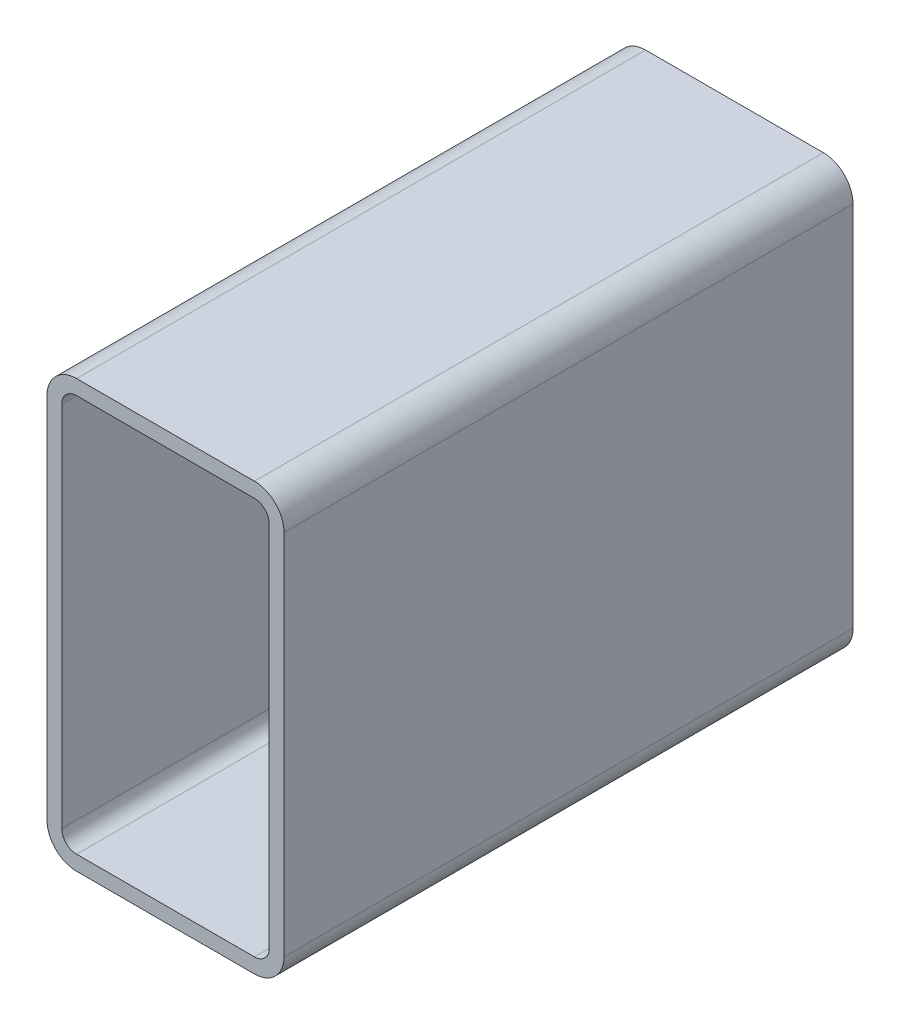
ISO-10303-21;
HEADER;
FILE_DESCRIPTION(('STEP AP214'),'2;1');
FILE_NAME('part.step','',(''),(''),'','','');
FILE_SCHEMA(('AUTOMOTIVE_DESIGN { 1 0 10303 214 1 1 1 1 }'));
ENDSEC;
DATA;
#1=APPLICATION_CONTEXT('core data for automotive mechanical design processes');
#2=APPLICATION_PROTOCOL_DEFINITION('international standard','automotive_design',2000,#1);
#3=PRODUCT_CONTEXT('',#1,'mechanical');
#4=PRODUCT('Part','Part','',(#3));
#5=PRODUCT_RELATED_PRODUCT_CATEGORY('part','',(#4));
#6=PRODUCT_DEFINITION_FORMATION('','',#4);
#7=PRODUCT_DEFINITION_CONTEXT('part definition',#1,'design');
#8=PRODUCT_DEFINITION('design','',#6,#7);
#9=PRODUCT_DEFINITION_SHAPE('','',#8);
#10=(LENGTH_UNIT() NAMED_UNIT(*) SI_UNIT(.MILLI.,.METRE.));
#11=(NAMED_UNIT(*) PLANE_ANGLE_UNIT() SI_UNIT($,.RADIAN.));
#12=(NAMED_UNIT(*) SI_UNIT($,.STERADIAN.) SOLID_ANGLE_UNIT());
#13=UNCERTAINTY_MEASURE_WITH_UNIT(LENGTH_MEASURE(1.E-05),#10,'distance_accuracy_value','');
#14=(GEOMETRIC_REPRESENTATION_CONTEXT(3) GLOBAL_UNCERTAINTY_ASSIGNED_CONTEXT((#13)) GLOBAL_UNIT_ASSIGNED_CONTEXT((#10,
#11,#12)) REPRESENTATION_CONTEXT('',''));
#15=CARTESIAN_POINT('',(0.,0.,0.));
#16=DIRECTION('',(0.,0.,1.));
#17=DIRECTION('',(1.,0.,0.));
#18=AXIS2_PLACEMENT_3D('',#15,#16,#17);
#19=CARTESIAN_POINT('',(16.7362396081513,214.668222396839,304.8));
#20=DIRECTION('',(0.,0.,1.));
#21=DIRECTION('',(1.,0.,0.));
#22=AXIS2_PLACEMENT_3D('',#19,#20,#21);
#23=PLANE('',#22);
#24=CARTESIAN_POINT('',(16.7362396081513,214.668222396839,304.8));
#25=DIRECTION('',(0.,0.,1.));
#26=DIRECTION('',(1.,0.,0.));
#27=AXIS2_PLACEMENT_3D('',#24,#25,#26);
#28=CIRCLE('',#27,15.875);
#29=CARTESIAN_POINT('',(16.7362396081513,230.543222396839,304.8));
#30=VERTEX_POINT('',#29);
#31=CARTESIAN_POINT('',(0.8612396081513,214.668222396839,304.8));
#32=VERTEX_POINT('',#31);
#33=EDGE_CURVE('E211',#30,#32,#28,.T.);
#34=ORIENTED_EDGE('',*,*,#33,.T.);
#35=DIRECTION('',(0.,-1.,0.));
#36=VECTOR('',#35,1.);
#37=CARTESIAN_POINT('',(0.8612396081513,17.8182223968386,304.8));
#38=LINE('',#37,#36);
#39=CARTESIAN_POINT('',(0.8612396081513,17.8182223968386,304.8));
#40=VERTEX_POINT('',#39);
#41=EDGE_CURVE('E214',#32,#40,#38,.T.);
#42=ORIENTED_EDGE('',*,*,#41,.T.);
#43=CARTESIAN_POINT('',(16.7362396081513,17.8182223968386,304.8));
#44=DIRECTION('',(0.,0.,1.));
#45=DIRECTION('',(1.,0.,0.));
#46=AXIS2_PLACEMENT_3D('',#43,#44,#45);
#47=CIRCLE('',#46,15.875);
#48=CARTESIAN_POINT('',(16.7362396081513,1.94322239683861,304.8));
#49=VERTEX_POINT('',#48);
#50=EDGE_CURVE('E217',#40,#49,#47,.T.);
#51=ORIENTED_EDGE('',*,*,#50,.T.);
#52=DIRECTION('',(1.,0.,0.));
#53=VECTOR('',#52,1.);
#54=CARTESIAN_POINT('',(111.986239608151,1.94322239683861,304.8));
#55=LINE('',#54,#53);
#56=CARTESIAN_POINT('',(111.986239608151,1.94322239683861,304.8));
#57=VERTEX_POINT('',#56);
#58=EDGE_CURVE('E219',#49,#57,#55,.T.);
#59=ORIENTED_EDGE('',*,*,#58,.T.);
#60=CARTESIAN_POINT('',(111.986239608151,17.8182223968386,304.8));
#61=DIRECTION('',(0.,0.,1.));
#62=DIRECTION('',(1.,0.,0.));
#63=AXIS2_PLACEMENT_3D('',#60,#61,#62);
#64=CIRCLE('',#63,15.875);
#65=CARTESIAN_POINT('',(127.861239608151,17.8182223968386,304.8));
#66=VERTEX_POINT('',#65);
#67=EDGE_CURVE('E221',#57,#66,#64,.T.);
#68=ORIENTED_EDGE('',*,*,#67,.T.);
#69=DIRECTION('',(0.,1.,0.));
#70=VECTOR('',#69,1.);
#71=CARTESIAN_POINT('',(127.861239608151,214.668222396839,304.8));
#72=LINE('',#71,#70);
#73=CARTESIAN_POINT('',(127.861239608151,214.668222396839,304.8));
#74=VERTEX_POINT('',#73);
#75=EDGE_CURVE('E223',#66,#74,#72,.T.);
#76=ORIENTED_EDGE('',*,*,#75,.T.);
#77=CARTESIAN_POINT('',(111.986239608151,214.668222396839,304.8));
#78=DIRECTION('',(0.,0.,1.));
#79=DIRECTION('',(1.,0.,0.));
#80=AXIS2_PLACEMENT_3D('',#77,#78,#79);
#81=CIRCLE('',#80,15.875);
#82=CARTESIAN_POINT('',(111.986239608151,230.543222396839,304.8));
#83=VERTEX_POINT('',#82);
#84=EDGE_CURVE('E225',#74,#83,#81,.T.);
#85=ORIENTED_EDGE('',*,*,#84,.T.);
#86=DIRECTION('',(-1.,0.,0.));
#87=VECTOR('',#86,1.);
#88=CARTESIAN_POINT('',(16.7362396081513,230.543222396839,304.8));
#89=LINE('',#88,#87);
#90=EDGE_CURVE('E227',#83,#30,#89,.T.);
#91=ORIENTED_EDGE('',*,*,#90,.T.);
#92=EDGE_LOOP('',(#34,#42,#51,#59,#68,#76,#85,#91));
#93=FACE_BOUND('',#92,.T.);
#94=DIRECTION('',(0.,-1.,0.));
#95=VECTOR('',#94,1.);
#96=CARTESIAN_POINT('',(8.7987396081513,17.8182223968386,304.8));
#97=LINE('',#96,#95);
#98=CARTESIAN_POINT('',(8.7987396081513,214.668222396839,304.8));
#99=VERTEX_POINT('',#98);
#100=CARTESIAN_POINT('',(8.7987396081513,17.8182223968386,304.8));
#101=VERTEX_POINT('',#100);
#102=EDGE_CURVE('E154',#99,#101,#97,.T.);
#103=ORIENTED_EDGE('',*,*,#102,.F.);
#104=CARTESIAN_POINT('',(16.7362396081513,214.668222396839,304.8));
#105=DIRECTION('',(0.,0.,1.));
#106=DIRECTION('',(1.,0.,0.));
#107=AXIS2_PLACEMENT_3D('',#104,#105,#106);
#108=CIRCLE('',#107,7.9375);
#109=CARTESIAN_POINT('',(16.7362396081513,222.605722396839,304.8));
#110=VERTEX_POINT('',#109);
#111=EDGE_CURVE('E146',#110,#99,#108,.T.);
#112=ORIENTED_EDGE('',*,*,#111,.F.);
#113=DIRECTION('',(-1.,0.,0.));
#114=VECTOR('',#113,1.);
#115=CARTESIAN_POINT('',(16.7362396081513,222.605722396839,304.8));
#116=LINE('',#115,#114);
#117=CARTESIAN_POINT('',(111.986239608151,222.605722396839,304.8));
#118=VERTEX_POINT('',#117);
#119=EDGE_CURVE('E179',#118,#110,#116,.T.);
#120=ORIENTED_EDGE('',*,*,#119,.F.);
#121=CARTESIAN_POINT('',(111.986239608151,214.668222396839,304.8));
#122=DIRECTION('',(0.,0.,1.));
#123=DIRECTION('',(1.,0.,0.));
#124=AXIS2_PLACEMENT_3D('',#121,#122,#123);
#125=CIRCLE('',#124,7.9375);
#126=CARTESIAN_POINT('',(119.923739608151,214.668222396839,304.8));
#127=VERTEX_POINT('',#126);
#128=EDGE_CURVE('E177',#127,#118,#125,.T.);
#129=ORIENTED_EDGE('',*,*,#128,.F.);
#130=DIRECTION('',(0.,1.,0.));
#131=VECTOR('',#130,1.);
#132=CARTESIAN_POINT('',(119.923739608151,214.668222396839,304.8));
#133=LINE('',#132,#131);
#134=CARTESIAN_POINT('',(119.923739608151,17.8182223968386,304.8));
#135=VERTEX_POINT('',#134);
#136=EDGE_CURVE('E175',#135,#127,#133,.T.);
#137=ORIENTED_EDGE('',*,*,#136,.F.);
#138=CARTESIAN_POINT('',(111.986239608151,17.8182223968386,304.8));
#139=DIRECTION('',(0.,0.,1.));
#140=DIRECTION('',(1.,0.,0.));
#141=AXIS2_PLACEMENT_3D('',#138,#139,#140);
#142=CIRCLE('',#141,7.9375);
#143=CARTESIAN_POINT('',(111.986239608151,9.88072239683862,304.8));
#144=VERTEX_POINT('',#143);
#145=EDGE_CURVE('E173',#144,#135,#142,.T.);
#146=ORIENTED_EDGE('',*,*,#145,.F.);
#147=DIRECTION('',(1.,0.,0.));
#148=VECTOR('',#147,1.);
#149=CARTESIAN_POINT('',(111.986239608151,9.88072239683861,304.8));
#150=LINE('',#149,#148);
#151=CARTESIAN_POINT('',(16.7362396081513,9.88072239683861,304.8));
#152=VERTEX_POINT('',#151);
#153=EDGE_CURVE('E169',#152,#144,#150,.T.);
#154=ORIENTED_EDGE('',*,*,#153,.F.);
#155=CARTESIAN_POINT('',(16.7362396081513,17.8182223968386,304.8));
#156=DIRECTION('',(0.,0.,1.));
#157=DIRECTION('',(1.,0.,0.));
#158=AXIS2_PLACEMENT_3D('',#155,#156,#157);
#159=CIRCLE('',#158,7.9375);
#160=EDGE_CURVE('E167',#101,#152,#159,.T.);
#161=ORIENTED_EDGE('',*,*,#160,.F.);
#162=EDGE_LOOP('',(#103,#112,#120,#129,#137,#146,#154,#161));
#163=FACE_BOUND('',#162,.T.);
#164=ADVANCED_FACE('F33',(#93,#163),#23,.T.);
#165=CARTESIAN_POINT('',(16.7362396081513,214.668222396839,0.));
#166=DIRECTION('',(0.,0.,1.));
#167=DIRECTION('',(1.,0.,0.));
#168=AXIS2_PLACEMENT_3D('',#165,#166,#167);
#169=PLANE('',#168);
#170=CARTESIAN_POINT('',(16.7362396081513,214.668222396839,0.));
#171=DIRECTION('',(0.,0.,1.));
#172=DIRECTION('',(1.,0.,0.));
#173=AXIS2_PLACEMENT_3D('',#170,#171,#172);
#174=CIRCLE('',#173,15.875);
#175=CARTESIAN_POINT('',(16.7362396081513,230.543222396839,0.));
#176=VERTEX_POINT('',#175);
#177=CARTESIAN_POINT('',(0.8612396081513,214.668222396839,0.));
#178=VERTEX_POINT('',#177);
#179=EDGE_CURVE('E162',#176,#178,#174,.T.);
#180=ORIENTED_EDGE('',*,*,#179,.F.);
#181=DIRECTION('',(-1.,0.,0.));
#182=VECTOR('',#181,1.);
#183=CARTESIAN_POINT('',(16.7362396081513,230.543222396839,0.));
#184=LINE('',#183,#182);
#185=CARTESIAN_POINT('',(111.986239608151,230.543222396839,0.));
#186=VERTEX_POINT('',#185);
#187=EDGE_CURVE('E215',#186,#176,#184,.T.);
#188=ORIENTED_EDGE('',*,*,#187,.F.);
#189=CARTESIAN_POINT('',(111.986239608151,214.668222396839,0.));
#190=DIRECTION('',(0.,0.,1.));
#191=DIRECTION('',(1.,0.,0.));
#192=AXIS2_PLACEMENT_3D('',#189,#190,#191);
#193=CIRCLE('',#192,15.875);
#194=CARTESIAN_POINT('',(127.861239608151,214.668222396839,0.));
#195=VERTEX_POINT('',#194);
#196=EDGE_CURVE('E242',#195,#186,#193,.T.);
#197=ORIENTED_EDGE('',*,*,#196,.F.);
#198=DIRECTION('',(0.,1.,0.));
#199=VECTOR('',#198,1.);
#200=CARTESIAN_POINT('',(127.861239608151,214.668222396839,0.));
#201=LINE('',#200,#199);
#202=CARTESIAN_POINT('',(127.861239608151,17.8182223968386,0.));
#203=VERTEX_POINT('',#202);
#204=EDGE_CURVE('E240',#203,#195,#201,.T.);
#205=ORIENTED_EDGE('',*,*,#204,.F.);
#206=CARTESIAN_POINT('',(111.986239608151,17.8182223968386,0.));
#207=DIRECTION('',(0.,0.,1.));
#208=DIRECTION('',(1.,0.,0.));
#209=AXIS2_PLACEMENT_3D('',#206,#207,#208);
#210=CIRCLE('',#209,15.875);
#211=CARTESIAN_POINT('',(111.986239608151,1.94322239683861,0.));
#212=VERTEX_POINT('',#211);
#213=EDGE_CURVE('E238',#212,#203,#210,.T.);
#214=ORIENTED_EDGE('',*,*,#213,.F.);
#215=DIRECTION('',(1.,0.,0.));
#216=VECTOR('',#215,1.);
#217=CARTESIAN_POINT('',(111.986239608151,1.94322239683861,0.));
#218=LINE('',#217,#216);
#219=CARTESIAN_POINT('',(16.7362396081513,1.94322239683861,0.));
#220=VERTEX_POINT('',#219);
#221=EDGE_CURVE('E236',#220,#212,#218,.T.);
#222=ORIENTED_EDGE('',*,*,#221,.F.);
#223=CARTESIAN_POINT('',(16.7362396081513,17.8182223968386,0.));
#224=DIRECTION('',(0.,0.,1.));
#225=DIRECTION('',(1.,0.,0.));
#226=AXIS2_PLACEMENT_3D('',#223,#224,#225);
#227=CIRCLE('',#226,15.875);
#228=CARTESIAN_POINT('',(0.8612396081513,17.8182223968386,0.));
#229=VERTEX_POINT('',#228);
#230=EDGE_CURVE('E234',#229,#220,#227,.T.);
#231=ORIENTED_EDGE('',*,*,#230,.F.);
#232=DIRECTION('',(0.,-1.,0.));
#233=VECTOR('',#232,1.);
#234=CARTESIAN_POINT('',(0.8612396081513,17.8182223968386,0.));
#235=LINE('',#234,#233);
#236=EDGE_CURVE('E232',#178,#229,#235,.T.);
#237=ORIENTED_EDGE('',*,*,#236,.F.);
#238=EDGE_LOOP('',(#180,#188,#197,#205,#214,#222,#231,#237));
#239=FACE_BOUND('',#238,.T.);
#240=CARTESIAN_POINT('',(16.7362396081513,214.668222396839,0.));
#241=DIRECTION('',(0.,0.,1.));
#242=DIRECTION('',(1.,0.,0.));
#243=AXIS2_PLACEMENT_3D('',#240,#241,#242);
#244=CIRCLE('',#243,7.9375);
#245=CARTESIAN_POINT('',(16.7362396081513,222.605722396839,0.));
#246=VERTEX_POINT('',#245);
#247=CARTESIAN_POINT('',(8.7987396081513,214.668222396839,0.));
#248=VERTEX_POINT('',#247);
#249=EDGE_CURVE('E56',#246,#248,#244,.T.);
#250=ORIENTED_EDGE('',*,*,#249,.T.);
#251=DIRECTION('',(0.,-1.,0.));
#252=VECTOR('',#251,1.);
#253=CARTESIAN_POINT('',(8.7987396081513,17.8182223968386,0.));
#254=LINE('',#253,#252);
#255=CARTESIAN_POINT('',(8.7987396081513,17.8182223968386,0.));
#256=VERTEX_POINT('',#255);
#257=EDGE_CURVE('E161',#248,#256,#254,.T.);
#258=ORIENTED_EDGE('',*,*,#257,.T.);
#259=CARTESIAN_POINT('',(16.7362396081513,17.8182223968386,0.));
#260=DIRECTION('',(0.,0.,1.));
#261=DIRECTION('',(1.,0.,0.));
#262=AXIS2_PLACEMENT_3D('',#259,#260,#261);
#263=CIRCLE('',#262,7.9375);
#264=CARTESIAN_POINT('',(16.7362396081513,9.88072239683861,0.));
#265=VERTEX_POINT('',#264);
#266=EDGE_CURVE('E183',#256,#265,#263,.T.);
#267=ORIENTED_EDGE('',*,*,#266,.T.);
#268=DIRECTION('',(1.,0.,0.));
#269=VECTOR('',#268,1.);
#270=CARTESIAN_POINT('',(111.986239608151,9.88072239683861,0.));
#271=LINE('',#270,#269);
#272=CARTESIAN_POINT('',(111.986239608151,9.88072239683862,0.));
#273=VERTEX_POINT('',#272);
#274=EDGE_CURVE('E186',#265,#273,#271,.T.);
#275=ORIENTED_EDGE('',*,*,#274,.T.);
#276=CARTESIAN_POINT('',(111.986239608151,17.8182223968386,0.));
#277=DIRECTION('',(0.,0.,1.));
#278=DIRECTION('',(1.,0.,0.));
#279=AXIS2_PLACEMENT_3D('',#276,#277,#278);
#280=CIRCLE('',#279,7.9375);
#281=CARTESIAN_POINT('',(119.923739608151,17.8182223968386,0.));
#282=VERTEX_POINT('',#281);
#283=EDGE_CURVE('E189',#273,#282,#280,.T.);
#284=ORIENTED_EDGE('',*,*,#283,.T.);
#285=DIRECTION('',(0.,1.,0.));
#286=VECTOR('',#285,1.);
#287=CARTESIAN_POINT('',(119.923739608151,214.668222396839,0.));
#288=LINE('',#287,#286);
#289=CARTESIAN_POINT('',(119.923739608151,214.668222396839,0.));
#290=VERTEX_POINT('',#289);
#291=EDGE_CURVE('E192',#282,#290,#288,.T.);
#292=ORIENTED_EDGE('',*,*,#291,.T.);
#293=CARTESIAN_POINT('',(111.986239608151,214.668222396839,0.));
#294=DIRECTION('',(0.,0.,1.));
#295=DIRECTION('',(1.,0.,0.));
#296=AXIS2_PLACEMENT_3D('',#293,#294,#295);
#297=CIRCLE('',#296,7.9375);
#298=CARTESIAN_POINT('',(111.986239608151,222.605722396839,0.));
#299=VERTEX_POINT('',#298);
#300=EDGE_CURVE('E195',#290,#299,#297,.T.);
#301=ORIENTED_EDGE('',*,*,#300,.T.);
#302=DIRECTION('',(-1.,0.,0.));
#303=VECTOR('',#302,1.);
#304=CARTESIAN_POINT('',(16.7362396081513,222.605722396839,0.));
#305=LINE('',#304,#303);
#306=EDGE_CURVE('E155',#299,#246,#305,.T.);
#307=ORIENTED_EDGE('',*,*,#306,.T.);
#308=EDGE_LOOP('',(#250,#258,#267,#275,#284,#292,#301,#307));
#309=FACE_BOUND('',#308,.T.);
#310=ADVANCED_FACE('F272',(#239,#309),#169,.F.);
#311=CARTESIAN_POINT('',(16.7362396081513,214.668222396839,304.8));
#312=DIRECTION('',(0.,0.,-1.));
#313=DIRECTION('',(-1.,0.,0.));
#314=AXIS2_PLACEMENT_3D('',#311,#312,#313);
#315=CYLINDRICAL_SURFACE('',#314,15.875);
#316=ORIENTED_EDGE('',*,*,#179,.T.);
#317=DIRECTION('',(0.,0.,-1.));
#318=VECTOR('',#317,1.);
#319=CARTESIAN_POINT('',(0.8612396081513,214.668222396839,304.8));
#320=LINE('',#319,#318);
#321=EDGE_CURVE('E11',#32,#178,#320,.T.);
#322=ORIENTED_EDGE('',*,*,#321,.F.);
#323=ORIENTED_EDGE('',*,*,#33,.F.);
#324=DIRECTION('',(0.,0.,-1.));
#325=VECTOR('',#324,1.);
#326=CARTESIAN_POINT('',(16.7362396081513,230.543222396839,304.8));
#327=LINE('',#326,#325);
#328=EDGE_CURVE('E229',#30,#176,#327,.T.);
#329=ORIENTED_EDGE('',*,*,#328,.T.);
#330=EDGE_LOOP('',(#316,#322,#323,#329));
#331=FACE_BOUND('',#330,.T.);
#332=ADVANCED_FACE('F35',(#331),#315,.T.);
#333=CARTESIAN_POINT('',(0.8612396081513,17.8182223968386,304.8));
#334=DIRECTION('',(1.,0.,0.));
#335=DIRECTION('',(0.,0.,-1.));
#336=AXIS2_PLACEMENT_3D('',#333,#334,#335);
#337=PLANE('',#336);
#338=ORIENTED_EDGE('',*,*,#236,.T.);
#339=DIRECTION('',(0.,0.,-1.));
#340=VECTOR('',#339,1.);
#341=CARTESIAN_POINT('',(0.8612396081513,17.8182223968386,304.8));
#342=LINE('',#341,#340);
#343=EDGE_CURVE('E41',#40,#229,#342,.T.);
#344=ORIENTED_EDGE('',*,*,#343,.F.);
#345=ORIENTED_EDGE('',*,*,#41,.F.);
#346=ORIENTED_EDGE('',*,*,#321,.T.);
#347=EDGE_LOOP('',(#338,#344,#345,#346));
#348=FACE_BOUND('',#347,.T.);
#349=ADVANCED_FACE('F289',(#348),#337,.F.);
#350=CARTESIAN_POINT('',(16.7362396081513,17.8182223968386,304.8));
#351=DIRECTION('',(0.,0.,-1.));
#352=DIRECTION('',(-1.,0.,0.));
#353=AXIS2_PLACEMENT_3D('',#350,#351,#352);
#354=CYLINDRICAL_SURFACE('',#353,15.875);
#355=ORIENTED_EDGE('',*,*,#230,.T.);
#356=DIRECTION('',(0.,0.,-1.));
#357=VECTOR('',#356,1.);
#358=CARTESIAN_POINT('',(16.7362396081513,1.94322239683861,304.8));
#359=LINE('',#358,#357);
#360=EDGE_CURVE('E259',#49,#220,#359,.T.);
#361=ORIENTED_EDGE('',*,*,#360,.F.);
#362=ORIENTED_EDGE('',*,*,#50,.F.);
#363=ORIENTED_EDGE('',*,*,#343,.T.);
#364=EDGE_LOOP('',(#355,#361,#362,#363));
#365=FACE_BOUND('',#364,.T.);
#366=ADVANCED_FACE('F266',(#365),#354,.T.);
#367=CARTESIAN_POINT('',(111.986239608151,1.94322239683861,304.8));
#368=DIRECTION('',(0.,1.,0.));
#369=DIRECTION('',(0.,0.,1.));
#370=AXIS2_PLACEMENT_3D('',#367,#368,#369);
#371=PLANE('',#370);
#372=ORIENTED_EDGE('',*,*,#221,.T.);
#373=DIRECTION('',(0.,0.,-1.));
#374=VECTOR('',#373,1.);
#375=CARTESIAN_POINT('',(111.986239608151,1.94322239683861,304.8));
#376=LINE('',#375,#374);
#377=EDGE_CURVE('E256',#57,#212,#376,.T.);
#378=ORIENTED_EDGE('',*,*,#377,.F.);
#379=ORIENTED_EDGE('',*,*,#58,.F.);
#380=ORIENTED_EDGE('',*,*,#360,.T.);
#381=EDGE_LOOP('',(#372,#378,#379,#380));
#382=FACE_BOUND('',#381,.T.);
#383=ADVANCED_FACE('F278',(#382),#371,.F.);
#384=CARTESIAN_POINT('',(111.986239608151,17.8182223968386,304.8));
#385=DIRECTION('',(0.,0.,-1.));
#386=DIRECTION('',(-1.,0.,0.));
#387=AXIS2_PLACEMENT_3D('',#384,#385,#386);
#388=CYLINDRICAL_SURFACE('',#387,15.875);
#389=ORIENTED_EDGE('',*,*,#213,.T.);
#390=DIRECTION('',(0.,0.,-1.));
#391=VECTOR('',#390,1.);
#392=CARTESIAN_POINT('',(127.861239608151,17.8182223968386,304.8));
#393=LINE('',#392,#391);
#394=EDGE_CURVE('E253',#66,#203,#393,.T.);
#395=ORIENTED_EDGE('',*,*,#394,.F.);
#396=ORIENTED_EDGE('',*,*,#67,.F.);
#397=ORIENTED_EDGE('',*,*,#377,.T.);
#398=EDGE_LOOP('',(#389,#395,#396,#397));
#399=FACE_BOUND('',#398,.T.);
#400=ADVANCED_FACE('F282',(#399),#388,.T.);
#401=CARTESIAN_POINT('',(127.861239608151,214.668222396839,304.8));
#402=DIRECTION('',(-1.,0.,0.));
#403=DIRECTION('',(0.,0.,1.));
#404=AXIS2_PLACEMENT_3D('',#401,#402,#403);
#405=PLANE('',#404);
#406=ORIENTED_EDGE('',*,*,#204,.T.);
#407=DIRECTION('',(0.,0.,-1.));
#408=VECTOR('',#407,1.);
#409=CARTESIAN_POINT('',(127.861239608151,214.668222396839,304.8));
#410=LINE('',#409,#408);
#411=EDGE_CURVE('E250',#74,#195,#410,.T.);
#412=ORIENTED_EDGE('',*,*,#411,.F.);
#413=ORIENTED_EDGE('',*,*,#75,.F.);
#414=ORIENTED_EDGE('',*,*,#394,.T.);
#415=EDGE_LOOP('',(#406,#412,#413,#414));
#416=FACE_BOUND('',#415,.T.);
#417=ADVANCED_FACE('F302',(#416),#405,.F.);
#418=CARTESIAN_POINT('',(111.986239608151,214.668222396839,304.8));
#419=DIRECTION('',(0.,0.,-1.));
#420=DIRECTION('',(-1.,0.,0.));
#421=AXIS2_PLACEMENT_3D('',#418,#419,#420);
#422=CYLINDRICAL_SURFACE('',#421,15.875);
#423=ORIENTED_EDGE('',*,*,#196,.T.);
#424=DIRECTION('',(0.,0.,-1.));
#425=VECTOR('',#424,1.);
#426=CARTESIAN_POINT('',(111.986239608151,230.543222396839,304.8));
#427=LINE('',#426,#425);
#428=EDGE_CURVE('E247',#83,#186,#427,.T.);
#429=ORIENTED_EDGE('',*,*,#428,.F.);
#430=ORIENTED_EDGE('',*,*,#84,.F.);
#431=ORIENTED_EDGE('',*,*,#411,.T.);
#432=EDGE_LOOP('',(#423,#429,#430,#431));
#433=FACE_BOUND('',#432,.T.);
#434=ADVANCED_FACE('F300',(#433),#422,.T.);
#435=CARTESIAN_POINT('',(16.7362396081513,230.543222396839,304.8));
#436=DIRECTION('',(0.,-1.,0.));
#437=DIRECTION('',(0.,0.,-1.));
#438=AXIS2_PLACEMENT_3D('',#435,#436,#437);
#439=PLANE('',#438);
#440=ORIENTED_EDGE('',*,*,#187,.T.);
#441=ORIENTED_EDGE('',*,*,#328,.F.);
#442=ORIENTED_EDGE('',*,*,#90,.F.);
#443=ORIENTED_EDGE('',*,*,#428,.T.);
#444=EDGE_LOOP('',(#440,#441,#442,#443));
#445=FACE_BOUND('',#444,.T.);
#446=ADVANCED_FACE('F295',(#445),#439,.F.);
#447=CARTESIAN_POINT('',(16.7362396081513,214.668222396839,304.8));
#448=DIRECTION('',(0.,0.,-1.));
#449=DIRECTION('',(-1.,0.,0.));
#450=AXIS2_PLACEMENT_3D('',#447,#448,#449);
#451=CYLINDRICAL_SURFACE('',#450,7.9375);
#452=ORIENTED_EDGE('',*,*,#249,.F.);
#453=DIRECTION('',(0.,0.,-1.));
#454=VECTOR('',#453,1.);
#455=CARTESIAN_POINT('',(16.7362396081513,222.605722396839,304.8));
#456=LINE('',#455,#454);
#457=EDGE_CURVE('E150',#110,#246,#456,.T.);
#458=ORIENTED_EDGE('',*,*,#457,.F.);
#459=ORIENTED_EDGE('',*,*,#111,.T.);
#460=DIRECTION('',(0.,0.,-1.));
#461=VECTOR('',#460,1.);
#462=CARTESIAN_POINT('',(8.7987396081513,214.668222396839,304.8));
#463=LINE('',#462,#461);
#464=EDGE_CURVE('E149',#99,#248,#463,.T.);
#465=ORIENTED_EDGE('',*,*,#464,.T.);
#466=EDGE_LOOP('',(#452,#458,#459,#465));
#467=FACE_BOUND('',#466,.T.);
#468=ADVANCED_FACE('F148',(#467),#451,.F.);
#469=CARTESIAN_POINT('',(8.7987396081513,17.8182223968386,304.8));
#470=DIRECTION('',(1.,0.,0.));
#471=DIRECTION('',(0.,0.,-1.));
#472=AXIS2_PLACEMENT_3D('',#469,#470,#471);
#473=PLANE('',#472);
#474=ORIENTED_EDGE('',*,*,#257,.F.);
#475=ORIENTED_EDGE('',*,*,#464,.F.);
#476=ORIENTED_EDGE('',*,*,#102,.T.);
#477=DIRECTION('',(0.,0.,-1.));
#478=VECTOR('',#477,1.);
#479=CARTESIAN_POINT('',(8.7987396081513,17.8182223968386,304.8));
#480=LINE('',#479,#478);
#481=EDGE_CURVE('E163',#101,#256,#480,.T.);
#482=ORIENTED_EDGE('',*,*,#481,.T.);
#483=EDGE_LOOP('',(#474,#475,#476,#482));
#484=FACE_BOUND('',#483,.T.);
#485=ADVANCED_FACE('F158',(#484),#473,.T.);
#486=CARTESIAN_POINT('',(16.7362396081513,17.8182223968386,304.8));
#487=DIRECTION('',(0.,0.,-1.));
#488=DIRECTION('',(-1.,0.,0.));
#489=AXIS2_PLACEMENT_3D('',#486,#487,#488);
#490=CYLINDRICAL_SURFACE('',#489,7.9375);
#491=ORIENTED_EDGE('',*,*,#266,.F.);
#492=ORIENTED_EDGE('',*,*,#481,.F.);
#493=ORIENTED_EDGE('',*,*,#160,.T.);
#494=DIRECTION('',(0.,0.,-1.));
#495=VECTOR('',#494,1.);
#496=CARTESIAN_POINT('',(16.7362396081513,9.88072239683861,304.8));
#497=LINE('',#496,#495);
#498=EDGE_CURVE('E208',#152,#265,#497,.T.);
#499=ORIENTED_EDGE('',*,*,#498,.T.);
#500=EDGE_LOOP('',(#491,#492,#493,#499));
#501=FACE_BOUND('',#500,.T.);
#502=ADVANCED_FACE('F327',(#501),#490,.F.);
#503=CARTESIAN_POINT('',(111.986239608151,9.88072239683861,304.8));
#504=DIRECTION('',(0.,1.,0.));
#505=DIRECTION('',(0.,0.,1.));
#506=AXIS2_PLACEMENT_3D('',#503,#504,#505);
#507=PLANE('',#506);
#508=ORIENTED_EDGE('',*,*,#274,.F.);
#509=ORIENTED_EDGE('',*,*,#498,.F.);
#510=ORIENTED_EDGE('',*,*,#153,.T.);
#511=DIRECTION('',(0.,0.,-1.));
#512=VECTOR('',#511,1.);
#513=CARTESIAN_POINT('',(111.986239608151,9.88072239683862,304.8));
#514=LINE('',#513,#512);
#515=EDGE_CURVE('E206',#144,#273,#514,.T.);
#516=ORIENTED_EDGE('',*,*,#515,.T.);
#517=EDGE_LOOP('',(#508,#509,#510,#516));
#518=FACE_BOUND('',#517,.T.);
#519=ADVANCED_FACE('F331',(#518),#507,.T.);
#520=CARTESIAN_POINT('',(111.986239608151,17.8182223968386,304.8));
#521=DIRECTION('',(0.,0.,-1.));
#522=DIRECTION('',(-1.,0.,0.));
#523=AXIS2_PLACEMENT_3D('',#520,#521,#522);
#524=CYLINDRICAL_SURFACE('',#523,7.9375);
#525=ORIENTED_EDGE('',*,*,#283,.F.);
#526=ORIENTED_EDGE('',*,*,#515,.F.);
#527=ORIENTED_EDGE('',*,*,#145,.T.);
#528=DIRECTION('',(0.,0.,-1.));
#529=VECTOR('',#528,1.);
#530=CARTESIAN_POINT('',(119.923739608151,17.8182223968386,304.8));
#531=LINE('',#530,#529);
#532=EDGE_CURVE('E204',#135,#282,#531,.T.);
#533=ORIENTED_EDGE('',*,*,#532,.T.);
#534=EDGE_LOOP('',(#525,#526,#527,#533));
#535=FACE_BOUND('',#534,.T.);
#536=ADVANCED_FACE('F337',(#535),#524,.F.);
#537=CARTESIAN_POINT('',(119.923739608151,214.668222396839,304.8));
#538=DIRECTION('',(-1.,0.,0.));
#539=DIRECTION('',(0.,0.,1.));
#540=AXIS2_PLACEMENT_3D('',#537,#538,#539);
#541=PLANE('',#540);
#542=ORIENTED_EDGE('',*,*,#291,.F.);
#543=ORIENTED_EDGE('',*,*,#532,.F.);
#544=ORIENTED_EDGE('',*,*,#136,.T.);
#545=DIRECTION('',(0.,0.,-1.));
#546=VECTOR('',#545,1.);
#547=CARTESIAN_POINT('',(119.923739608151,214.668222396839,304.8));
#548=LINE('',#547,#546);
#549=EDGE_CURVE('E202',#127,#290,#548,.T.);
#550=ORIENTED_EDGE('',*,*,#549,.T.);
#551=EDGE_LOOP('',(#542,#543,#544,#550));
#552=FACE_BOUND('',#551,.T.);
#553=ADVANCED_FACE('F341',(#552),#541,.T.);
#554=CARTESIAN_POINT('',(111.986239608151,214.668222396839,304.8));
#555=DIRECTION('',(0.,0.,-1.));
#556=DIRECTION('',(-1.,0.,0.));
#557=AXIS2_PLACEMENT_3D('',#554,#555,#556);
#558=CYLINDRICAL_SURFACE('',#557,7.9375);
#559=ORIENTED_EDGE('',*,*,#300,.F.);
#560=ORIENTED_EDGE('',*,*,#549,.F.);
#561=ORIENTED_EDGE('',*,*,#128,.T.);
#562=DIRECTION('',(0.,0.,-1.));
#563=VECTOR('',#562,1.);
#564=CARTESIAN_POINT('',(111.986239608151,222.605722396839,304.8));
#565=LINE('',#564,#563);
#566=EDGE_CURVE('E48',#118,#299,#565,.T.);
#567=ORIENTED_EDGE('',*,*,#566,.T.);
#568=EDGE_LOOP('',(#559,#560,#561,#567));
#569=FACE_BOUND('',#568,.T.);
#570=ADVANCED_FACE('F345',(#569),#558,.F.);
#571=CARTESIAN_POINT('',(16.7362396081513,222.605722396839,304.8));
#572=DIRECTION('',(0.,-1.,0.));
#573=DIRECTION('',(0.,0.,-1.));
#574=AXIS2_PLACEMENT_3D('',#571,#572,#573);
#575=PLANE('',#574);
#576=ORIENTED_EDGE('',*,*,#306,.F.);
#577=ORIENTED_EDGE('',*,*,#566,.F.);
#578=ORIENTED_EDGE('',*,*,#119,.T.);
#579=ORIENTED_EDGE('',*,*,#457,.T.);
#580=EDGE_LOOP('',(#576,#577,#578,#579));
#581=FACE_BOUND('',#580,.T.);
#582=ADVANCED_FACE('F349',(#581),#575,.T.);
#583=CLOSED_SHELL('',(#164,#310,#332,#349,#366,#383,#400,#417,#434,#446,#468,#485,#502,#519,
#536,#553,#570,#582));
#584=MANIFOLD_SOLID_BREP('B2',#583);
#585=ADVANCED_BREP_SHAPE_REPRESENTATION('',(#18,#584),#14);
#586=SHAPE_DEFINITION_REPRESENTATION(#9,#585);
ENDSEC;
END-ISO-10303-21;
